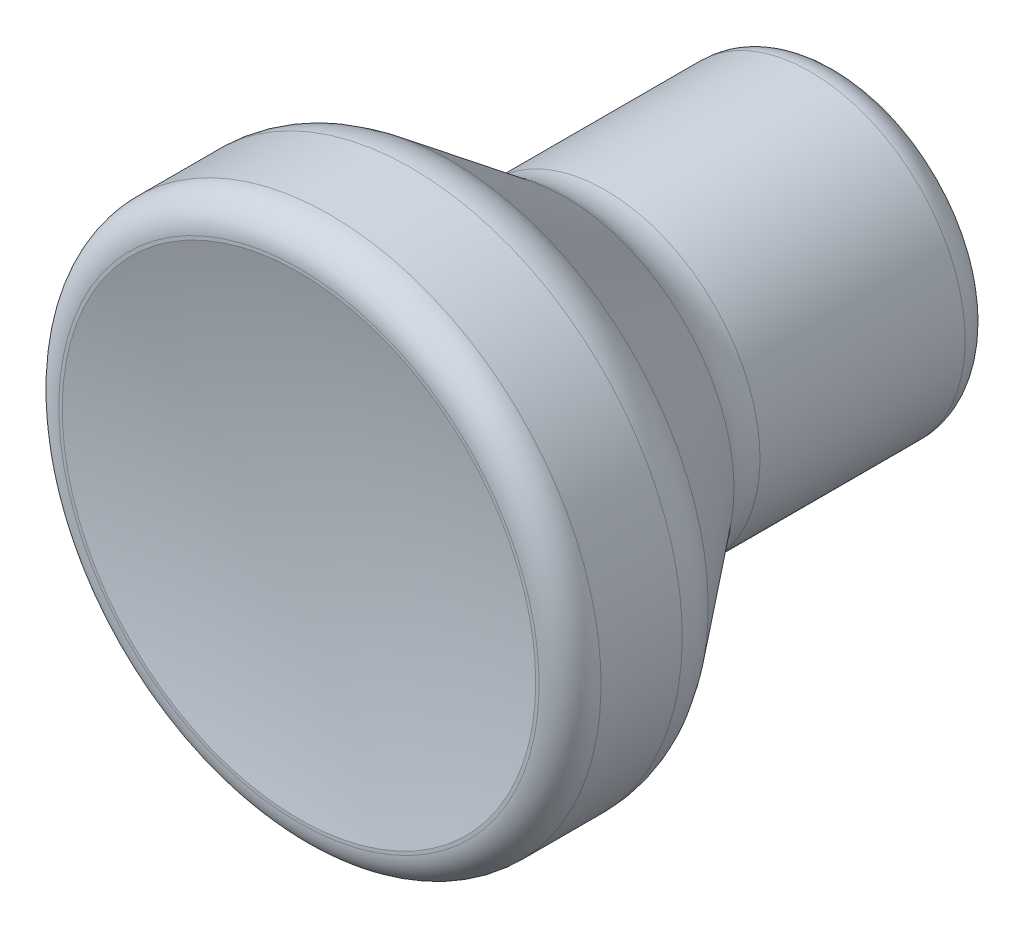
ISO-10303-21;
HEADER;
FILE_DESCRIPTION(('STEP AP214'),'2;1');
FILE_NAME('part.step','',(''),(''),'','','');
FILE_SCHEMA(('AUTOMOTIVE_DESIGN { 1 0 10303 214 1 1 1 1 }'));
ENDSEC;
DATA;
#1=APPLICATION_CONTEXT('core data for automotive mechanical design processes');
#2=APPLICATION_PROTOCOL_DEFINITION('international standard','automotive_design',2000,#1);
#3=PRODUCT_CONTEXT('',#1,'mechanical');
#4=PRODUCT('Part','Part','',(#3));
#5=PRODUCT_RELATED_PRODUCT_CATEGORY('part','',(#4));
#6=PRODUCT_DEFINITION_FORMATION('','',#4);
#7=PRODUCT_DEFINITION_CONTEXT('part definition',#1,'design');
#8=PRODUCT_DEFINITION('design','',#6,#7);
#9=PRODUCT_DEFINITION_SHAPE('','',#8);
#10=(LENGTH_UNIT() NAMED_UNIT(*) SI_UNIT(.MILLI.,.METRE.));
#11=(NAMED_UNIT(*) PLANE_ANGLE_UNIT() SI_UNIT($,.RADIAN.));
#12=(NAMED_UNIT(*) SI_UNIT($,.STERADIAN.) SOLID_ANGLE_UNIT());
#13=UNCERTAINTY_MEASURE_WITH_UNIT(LENGTH_MEASURE(1.E-05),#10,'distance_accuracy_value','');
#14=(GEOMETRIC_REPRESENTATION_CONTEXT(3) GLOBAL_UNCERTAINTY_ASSIGNED_CONTEXT((#13)) GLOBAL_UNIT_ASSIGNED_CONTEXT((#10,
#11,#12)) REPRESENTATION_CONTEXT('',''));
#15=CARTESIAN_POINT('',(0.,0.,0.));
#16=DIRECTION('',(0.,0.,1.));
#17=DIRECTION('',(1.,0.,0.));
#18=AXIS2_PLACEMENT_3D('',#15,#16,#17);
#19=CARTESIAN_POINT('',(0.,0.,19.8000017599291));
#20=DIRECTION('',(0.,0.,-1.));
#21=DIRECTION('',(0.,1.,0.));
#22=AXIS2_PLACEMENT_3D('',#19,#20,#21);
#23=TOROIDAL_SURFACE('',#22,9.29999486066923,1.2);
#24=CARTESIAN_POINT('',(0.,0.,19.8000017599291));
#25=DIRECTION('',(0.,0.,-1.));
#26=DIRECTION('',(0.,1.,0.));
#27=AXIS2_PLACEMENT_3D('',#24,#25,#26);
#28=CIRCLE('',#27,10.4999948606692);
#29=CARTESIAN_POINT('',(0.,10.4999948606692,19.8000017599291));
#30=VERTEX_POINT('',#29);
#31=EDGE_CURVE('E23',#30,#30,#28,.T.);
#32=ORIENTED_EDGE('',*,*,#31,.F.);
#33=EDGE_LOOP('',(#32));
#34=FACE_BOUND('',#33,.T.);
#35=CARTESIAN_POINT('',(0.,0.,21.0000017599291));
#36=DIRECTION('',(0.,0.,-1.));
#37=DIRECTION('',(0.,1.,0.));
#38=AXIS2_PLACEMENT_3D('',#35,#36,#37);
#39=CIRCLE('',#38,9.29999486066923);
#40=CARTESIAN_POINT('',(0.,9.29999486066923,21.0000017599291));
#41=VERTEX_POINT('',#40);
#42=EDGE_CURVE('E50',#41,#41,#39,.T.);
#43=ORIENTED_EDGE('',*,*,#42,.T.);
#44=EDGE_LOOP('',(#43));
#45=FACE_BOUND('',#44,.T.);
#46=ADVANCED_FACE('F12',(#34,#45),#23,.T.);
#47=CARTESIAN_POINT('',(0.,0.,0.));
#48=DIRECTION('',(0.,0.,-1.));
#49=DIRECTION('',(0.,1.,0.));
#50=AXIS2_PLACEMENT_3D('',#47,#48,#49);
#51=CYLINDRICAL_SURFACE('',#50,10.4999948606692);
#52=CARTESIAN_POINT('',(0.,0.,16.6561017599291));
#53=DIRECTION('',(0.,0.,-1.));
#54=DIRECTION('',(0.,1.,0.));
#55=AXIS2_PLACEMENT_3D('',#52,#53,#54);
#56=CIRCLE('',#55,10.4999948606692);
#57=CARTESIAN_POINT('',(0.,10.4999948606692,16.6561017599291));
#58=VERTEX_POINT('',#57);
#59=EDGE_CURVE('E27',#58,#58,#56,.T.);
#60=ORIENTED_EDGE('',*,*,#59,.F.);
#61=EDGE_LOOP('',(#60));
#62=FACE_BOUND('',#61,.T.);
#63=ORIENTED_EDGE('',*,*,#31,.T.);
#64=EDGE_LOOP('',(#63));
#65=FACE_BOUND('',#64,.T.);
#66=ADVANCED_FACE('F74',(#62,#65),#51,.T.);
#67=CARTESIAN_POINT('',(0.,0.,16.6561017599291));
#68=DIRECTION('',(0.,0.,-1.));
#69=DIRECTION('',(0.,1.,0.));
#70=AXIS2_PLACEMENT_3D('',#67,#68,#69);
#71=TOROIDAL_SURFACE('',#70,7.99999773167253,2.4999971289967);
#72=CARTESIAN_POINT('',(0.,0.,15.1236));
#73=DIRECTION('',(0.,0.,-1.));
#74=DIRECTION('',(0.,1.,0.));
#75=AXIS2_PLACEMENT_3D('',#72,#73,#74);
#76=CIRCLE('',#75,9.9752);
#77=CARTESIAN_POINT('',(0.,9.9752,15.1236));
#78=VERTEX_POINT('',#77);
#79=EDGE_CURVE('E32',#78,#78,#76,.T.);
#80=ORIENTED_EDGE('',*,*,#79,.F.);
#81=EDGE_LOOP('',(#80));
#82=FACE_BOUND('',#81,.T.);
#83=ORIENTED_EDGE('',*,*,#59,.T.);
#84=EDGE_LOOP('',(#83));
#85=FACE_BOUND('',#84,.T.);
#86=ADVANCED_FACE('F80',(#82,#85),#71,.T.);
#87=CARTESIAN_POINT('',(0.,0.,15.1236));
#88=DIRECTION('',(0.,0.,1.));
#89=DIRECTION('',(0.,-1.,0.));
#90=AXIS2_PLACEMENT_3D('',#87,#88,#89);
#91=CONICAL_SURFACE('',#90,9.9752,0.659847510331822);
#92=CARTESIAN_POINT('',(0.,0.,10.6764));
#93=DIRECTION('',(0.,0.,-1.));
#94=DIRECTION('',(0.,1.,0.));
#95=AXIS2_PLACEMENT_3D('',#92,#93,#94);
#96=CIRCLE('',#95,6.5247927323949);
#97=CARTESIAN_POINT('',(0.,6.5247927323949,10.6764));
#98=VERTEX_POINT('',#97);
#99=EDGE_CURVE('E35',#98,#98,#96,.T.);
#100=ORIENTED_EDGE('',*,*,#99,.F.);
#101=EDGE_LOOP('',(#100));
#102=FACE_BOUND('',#101,.T.);
#103=ORIENTED_EDGE('',*,*,#79,.T.);
#104=EDGE_LOOP('',(#103));
#105=FACE_BOUND('',#104,.T.);
#106=ADVANCED_FACE('F88',(#102,#105),#91,.T.);
#107=CARTESIAN_POINT('',(0.,0.,9.1439));
#108=DIRECTION('',(0.,0.,-1.));
#109=DIRECTION('',(0.,1.,0.));
#110=AXIS2_PLACEMENT_3D('',#107,#108,#109);
#111=TOROIDAL_SURFACE('',#110,8.5,2.5);
#112=CARTESIAN_POINT('',(0.,0.,9.1439));
#113=DIRECTION('',(0.,0.,-1.));
#114=DIRECTION('',(0.,1.,0.));
#115=AXIS2_PLACEMENT_3D('',#112,#113,#114);
#116=CIRCLE('',#115,6.);
#117=CARTESIAN_POINT('',(0.,6.,9.1439));
#118=VERTEX_POINT('',#117);
#119=EDGE_CURVE('E38',#118,#118,#116,.T.);
#120=ORIENTED_EDGE('',*,*,#119,.F.);
#121=EDGE_LOOP('',(#120));
#122=FACE_BOUND('',#121,.T.);
#123=ORIENTED_EDGE('',*,*,#99,.T.);
#124=EDGE_LOOP('',(#123));
#125=FACE_BOUND('',#124,.T.);
#126=ADVANCED_FACE('F92',(#122,#125),#111,.F.);
#127=CARTESIAN_POINT('',(0.,0.,0.));
#128=DIRECTION('',(0.,0.,-1.));
#129=DIRECTION('',(0.,1.,0.));
#130=AXIS2_PLACEMENT_3D('',#127,#128,#129);
#131=CYLINDRICAL_SURFACE('',#130,6.);
#132=CARTESIAN_POINT('',(0.,0.,1.2));
#133=DIRECTION('',(0.,0.,-1.));
#134=DIRECTION('',(0.,1.,0.));
#135=AXIS2_PLACEMENT_3D('',#132,#133,#134);
#136=CIRCLE('',#135,6.);
#137=CARTESIAN_POINT('',(0.,6.,1.2));
#138=VERTEX_POINT('',#137);
#139=EDGE_CURVE('E41',#138,#138,#136,.T.);
#140=ORIENTED_EDGE('',*,*,#139,.F.);
#141=EDGE_LOOP('',(#140));
#142=FACE_BOUND('',#141,.T.);
#143=ORIENTED_EDGE('',*,*,#119,.T.);
#144=EDGE_LOOP('',(#143));
#145=FACE_BOUND('',#144,.T.);
#146=ADVANCED_FACE('F96',(#142,#145),#131,.T.);
#147=CARTESIAN_POINT('',(0.,0.,1.2));
#148=DIRECTION('',(0.,0.,-1.));
#149=DIRECTION('',(0.,1.,0.));
#150=AXIS2_PLACEMENT_3D('',#147,#148,#149);
#151=TOROIDAL_SURFACE('',#150,4.8,1.2);
#152=CARTESIAN_POINT('',(0.,0.,0.));
#153=DIRECTION('',(0.,0.,-1.));
#154=DIRECTION('',(0.,1.,0.));
#155=AXIS2_PLACEMENT_3D('',#152,#153,#154);
#156=CIRCLE('',#155,4.8);
#157=CARTESIAN_POINT('',(0.,4.8,0.));
#158=VERTEX_POINT('',#157);
#159=EDGE_CURVE('E44',#158,#158,#156,.T.);
#160=ORIENTED_EDGE('',*,*,#159,.F.);
#161=EDGE_LOOP('',(#160));
#162=FACE_BOUND('',#161,.T.);
#163=ORIENTED_EDGE('',*,*,#139,.T.);
#164=EDGE_LOOP('',(#163));
#165=FACE_BOUND('',#164,.T.);
#166=ADVANCED_FACE('F100',(#162,#165),#151,.T.);
#167=CARTESIAN_POINT('',(0.,0.,0.));
#168=DIRECTION('',(0.,0.,1.));
#169=DIRECTION('',(0.,-1.,0.));
#170=AXIS2_PLACEMENT_3D('',#167,#168,#169);
#171=PLANE('',#170);
#172=CARTESIAN_POINT('',(0.,0.,0.));
#173=DIRECTION('',(0.,0.,1.));
#174=DIRECTION('',(1.,0.,0.));
#175=AXIS2_PLACEMENT_3D('',#172,#173,#174);
#176=CIRCLE('',#175,2.4);
#177=CARTESIAN_POINT('',(2.4,0.,0.));
#178=VERTEX_POINT('',#177);
#179=EDGE_CURVE('E8',#178,#178,#176,.T.);
#180=ORIENTED_EDGE('',*,*,#179,.T.);
#181=EDGE_LOOP('',(#180));
#182=FACE_BOUND('',#181,.T.);
#183=ORIENTED_EDGE('',*,*,#159,.T.);
#184=EDGE_LOOP('',(#183));
#185=FACE_BOUND('',#184,.T.);
#186=ADVANCED_FACE('F104',(#182,#185),#171,.F.);
#187=CARTESIAN_POINT('',(0.,0.,61.9871));
#188=DIRECTION('',(0.,0.,-1.));
#189=DIRECTION('',(1.,0.,0.));
#190=AXIS2_PLACEMENT_3D('',#187,#188,#189);
#191=SPHERICAL_SURFACE('',#190,42.000037);
#192=CARTESIAN_POINT('',(0.,0.,21.));
#193=DIRECTION('',(0.,0.,-1.));
#194=DIRECTION('',(0.,1.,0.));
#195=AXIS2_PLACEMENT_3D('',#192,#193,#194);
#196=CIRCLE('',#195,9.16846451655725);
#197=CARTESIAN_POINT('',(0.,9.16846451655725,21.));
#198=VERTEX_POINT('',#197);
#199=EDGE_CURVE('E47',#198,#198,#196,.T.);
#200=ORIENTED_EDGE('',*,*,#199,.F.);
#201=EDGE_LOOP('',(#200));
#202=FACE_BOUND('',#201,.T.);
#203=ADVANCED_FACE('F70',(#202),#191,.F.);
#204=CARTESIAN_POINT('',(-9.16846451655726,0.,21.));
#205=DIRECTION('',(0.,0.,-1.));
#206=DIRECTION('',(0.,1.,0.));
#207=AXIS2_PLACEMENT_3D('',#204,#205,#206);
#208=PLANE('',#207);
#209=ORIENTED_EDGE('',*,*,#42,.F.);
#210=EDGE_LOOP('',(#209));
#211=FACE_BOUND('',#210,.T.);
#212=ORIENTED_EDGE('',*,*,#199,.T.);
#213=EDGE_LOOP('',(#212));
#214=FACE_BOUND('',#213,.T.);
#215=ADVANCED_FACE('F61',(#211,#214),#208,.F.);
#216=CARTESIAN_POINT('',(0.,0.,10.));
#217=DIRECTION('',(0.,0.,-1.));
#218=DIRECTION('',(0.,1.,0.));
#219=AXIS2_PLACEMENT_3D('',#216,#217,#218);
#220=CYLINDRICAL_SURFACE('',#219,2.);
#221=CARTESIAN_POINT('',(0.,0.,0.399999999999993));
#222=DIRECTION('',(0.,0.,1.));
#223=DIRECTION('',(1.,0.,0.));
#224=AXIS2_PLACEMENT_3D('',#221,#222,#223);
#225=CIRCLE('',#224,2.);
#226=CARTESIAN_POINT('',(2.,0.,0.399999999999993));
#227=VERTEX_POINT('',#226);
#228=EDGE_CURVE('E19',#227,#227,#225,.F.);
#229=ORIENTED_EDGE('',*,*,#228,.T.);
#230=EDGE_LOOP('',(#229));
#231=FACE_BOUND('',#230,.T.);
#232=CARTESIAN_POINT('',(0.,0.,8.));
#233=DIRECTION('',(0.,0.,-1.));
#234=DIRECTION('',(-1.,0.,0.));
#235=AXIS2_PLACEMENT_3D('',#232,#233,#234);
#236=CIRCLE('',#235,2.);
#237=CARTESIAN_POINT('',(-2.,0.,8.));
#238=VERTEX_POINT('',#237);
#239=EDGE_CURVE('E53',#238,#238,#236,.T.);
#240=ORIENTED_EDGE('',*,*,#239,.F.);
#241=EDGE_LOOP('',(#240));
#242=FACE_BOUND('',#241,.T.);
#243=ADVANCED_FACE('F59',(#231,#242),#220,.F.);
#244=CARTESIAN_POINT('',(0.,0.,8.));
#245=DIRECTION('',(0.,0.,-1.));
#246=DIRECTION('',(-1.,0.,0.));
#247=AXIS2_PLACEMENT_3D('',#244,#245,#246);
#248=PLANE('',#247);
#249=ORIENTED_EDGE('',*,*,#239,.T.);
#250=EDGE_LOOP('',(#249));
#251=FACE_BOUND('',#250,.T.);
#252=ADVANCED_FACE('F57',(#251),#248,.T.);
#253=CARTESIAN_POINT('',(0.,0.,0.399999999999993));
#254=DIRECTION('',(0.,0.,-1.));
#255=DIRECTION('',(-1.,0.,0.));
#256=AXIS2_PLACEMENT_3D('',#253,#254,#255);
#257=CONICAL_SURFACE('',#256,2.,0.785398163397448);
#258=ORIENTED_EDGE('',*,*,#179,.F.);
#259=EDGE_LOOP('',(#258));
#260=FACE_BOUND('',#259,.T.);
#261=ORIENTED_EDGE('',*,*,#228,.F.);
#262=EDGE_LOOP('',(#261));
#263=FACE_BOUND('',#262,.T.);
#264=ADVANCED_FACE('F14',(#260,#263),#257,.F.);
#265=CLOSED_SHELL('',(#46,#66,#86,#106,#126,#146,#166,#186,#203,#215,#243,#252,#264));
#266=MANIFOLD_SOLID_BREP('B1',#265);
#267=ADVANCED_BREP_SHAPE_REPRESENTATION('',(#18,#266),#14);
#268=SHAPE_DEFINITION_REPRESENTATION(#9,#267);
ENDSEC;
END-ISO-10303-21;
